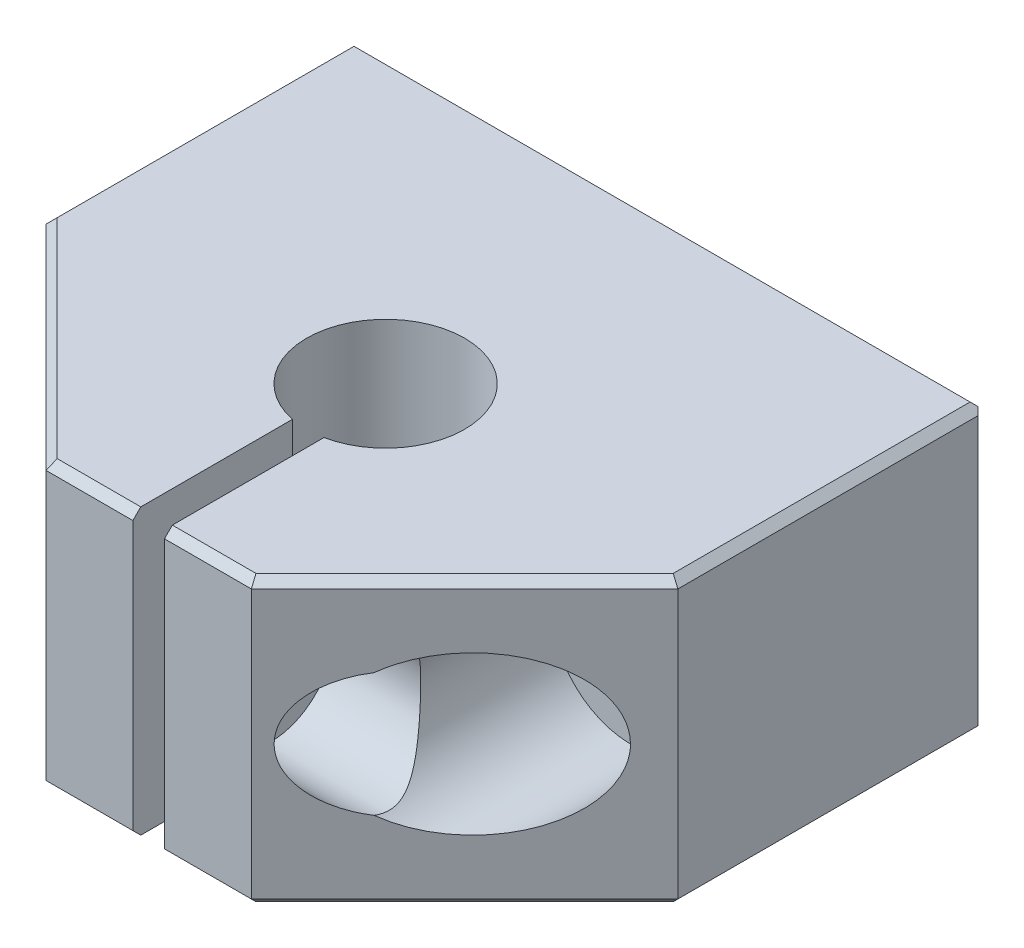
ISO-10303-21;
HEADER;
FILE_DESCRIPTION(('STEP AP214'),'2;1');
FILE_NAME('part.step','',(''),(''),'','','');
FILE_SCHEMA(('AUTOMOTIVE_DESIGN { 1 0 10303 214 1 1 1 1 }'));
ENDSEC;
DATA;
#1=APPLICATION_CONTEXT('core data for automotive mechanical design processes');
#2=APPLICATION_PROTOCOL_DEFINITION('international standard','automotive_design',2000,#1);
#3=PRODUCT_CONTEXT('',#1,'mechanical');
#4=PRODUCT('Part','Part','',(#3));
#5=PRODUCT_RELATED_PRODUCT_CATEGORY('part','',(#4));
#6=PRODUCT_DEFINITION_FORMATION('','',#4);
#7=PRODUCT_DEFINITION_CONTEXT('part definition',#1,'design');
#8=PRODUCT_DEFINITION('design','',#6,#7);
#9=PRODUCT_DEFINITION_SHAPE('','',#8);
#10=(LENGTH_UNIT() NAMED_UNIT(*) SI_UNIT(.MILLI.,.METRE.));
#11=(NAMED_UNIT(*) PLANE_ANGLE_UNIT() SI_UNIT($,.RADIAN.));
#12=(NAMED_UNIT(*) SI_UNIT($,.STERADIAN.) SOLID_ANGLE_UNIT());
#13=UNCERTAINTY_MEASURE_WITH_UNIT(LENGTH_MEASURE(1.E-05),#10,'distance_accuracy_value','');
#14=(GEOMETRIC_REPRESENTATION_CONTEXT(3) GLOBAL_UNCERTAINTY_ASSIGNED_CONTEXT((#13)) GLOBAL_UNIT_ASSIGNED_CONTEXT((#10,
#11,#12)) REPRESENTATION_CONTEXT('',''));
#15=CARTESIAN_POINT('',(0.,0.,0.));
#16=DIRECTION('',(0.,0.,1.));
#17=DIRECTION('',(1.,0.,0.));
#18=AXIS2_PLACEMENT_3D('',#15,#16,#17);
#19=CARTESIAN_POINT('',(-13.5,0.,-2.));
#20=DIRECTION('',(0.,0.,-1.));
#21=DIRECTION('',(-1.,0.,0.));
#22=AXIS2_PLACEMENT_3D('',#19,#20,#21);
#23=PLANE('',#22);
#24=CARTESIAN_POINT('',(-13.5,0.,-2.));
#25=DIRECTION('',(0.,0.,1.));
#26=DIRECTION('',(1.,0.,0.));
#27=AXIS2_PLACEMENT_3D('',#24,#25,#26);
#28=CIRCLE('',#27,2.6);
#29=CARTESIAN_POINT('',(-10.9,0.,-2.));
#30=VERTEX_POINT('',#29);
#31=EDGE_CURVE('E237',#30,#30,#28,.F.);
#32=ORIENTED_EDGE('',*,*,#31,.T.);
#33=EDGE_LOOP('',(#32));
#34=FACE_BOUND('',#33,.T.);
#35=CARTESIAN_POINT('',(-13.5,0.,-2.));
#36=DIRECTION('',(0.,0.,1.));
#37=DIRECTION('',(1.,0.,0.));
#38=AXIS2_PLACEMENT_3D('',#35,#36,#37);
#39=CIRCLE('',#38,5.);
#40=CARTESIAN_POINT('',(-8.5,0.,-2.));
#41=VERTEX_POINT('',#40);
#42=EDGE_CURVE('E20',#41,#41,#39,.T.);
#43=ORIENTED_EDGE('',*,*,#42,.T.);
#44=EDGE_LOOP('',(#43));
#45=FACE_BOUND('',#44,.T.);
#46=ADVANCED_FACE('F17',(#34,#45),#23,.F.);
#47=CARTESIAN_POINT('',(13.5,0.,-2.));
#48=DIRECTION('',(0.,0.,-1.));
#49=DIRECTION('',(-1.,0.,0.));
#50=AXIS2_PLACEMENT_3D('',#47,#48,#49);
#51=PLANE('',#50);
#52=CARTESIAN_POINT('',(13.5,0.,-2.));
#53=DIRECTION('',(0.,0.,1.));
#54=DIRECTION('',(1.,0.,0.));
#55=AXIS2_PLACEMENT_3D('',#52,#53,#54);
#56=CIRCLE('',#55,2.6);
#57=CARTESIAN_POINT('',(16.1,0.,-2.));
#58=VERTEX_POINT('',#57);
#59=EDGE_CURVE('E240',#58,#58,#56,.F.);
#60=ORIENTED_EDGE('',*,*,#59,.T.);
#61=EDGE_LOOP('',(#60));
#62=FACE_BOUND('',#61,.T.);
#63=CARTESIAN_POINT('',(13.5,0.,-2.));
#64=DIRECTION('',(0.,0.,1.));
#65=DIRECTION('',(1.,0.,0.));
#66=AXIS2_PLACEMENT_3D('',#63,#64,#65);
#67=CIRCLE('',#66,5.);
#68=CARTESIAN_POINT('',(18.5,0.,-2.));
#69=VERTEX_POINT('',#68);
#70=EDGE_CURVE('E160',#69,#69,#67,.T.);
#71=ORIENTED_EDGE('',*,*,#70,.T.);
#72=EDGE_LOOP('',(#71));
#73=FACE_BOUND('',#72,.T.);
#74=ADVANCED_FACE('F856',(#62,#73),#51,.F.);
#75=CARTESIAN_POINT('',(3.,0.,10.28));
#76=DIRECTION('',(-1.,0.,0.));
#77=DIRECTION('',(0.,0.,1.));
#78=AXIS2_PLACEMENT_3D('',#75,#76,#77);
#79=PLANE('',#78);
#80=CARTESIAN_POINT('',(3.,0.,10.28));
#81=DIRECTION('',(1.,0.,0.));
#82=DIRECTION('',(0.,0.,-1.));
#83=AXIS2_PLACEMENT_3D('',#80,#81,#82);
#84=CIRCLE('',#83,2.25);
#85=CARTESIAN_POINT('',(3.,0.,8.03));
#86=VERTEX_POINT('',#85);
#87=EDGE_CURVE('E198',#86,#86,#84,.F.);
#88=ORIENTED_EDGE('',*,*,#87,.T.);
#89=EDGE_LOOP('',(#88));
#90=FACE_BOUND('',#89,.T.);
#91=CARTESIAN_POINT('',(3.,0.,10.28));
#92=DIRECTION('',(1.,0.,0.));
#93=DIRECTION('',(0.,0.,-1.));
#94=AXIS2_PLACEMENT_3D('',#91,#92,#93);
#95=CIRCLE('',#94,4.);
#96=CARTESIAN_POINT('',(3.,0.,6.28));
#97=VERTEX_POINT('',#96);
#98=EDGE_CURVE('E161',#97,#97,#95,.T.);
#99=ORIENTED_EDGE('',*,*,#98,.T.);
#100=EDGE_LOOP('',(#99));
#101=FACE_BOUND('',#100,.T.);
#102=ADVANCED_FACE('F849',(#90,#101),#79,.F.);
#103=CARTESIAN_POINT('',(20.,-9.,14.5));
#104=DIRECTION('',(0.,0.707106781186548,-0.707106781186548));
#105=DIRECTION('',(0.,0.707106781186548,0.707106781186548));
#106=AXIS2_PLACEMENT_3D('',#103,#104,#105);
#107=PLANE('',#106);
#108=DIRECTION('',(1.,0.,0.));
#109=VECTOR('',#108,1.);
#110=CARTESIAN_POINT('',(0.,-8.5,15.));
#111=LINE('',#110,#109);
#112=CARTESIAN_POINT('',(0.999999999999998,-8.5,15.));
#113=VERTEX_POINT('',#112);
#114=CARTESIAN_POINT('',(6.49999999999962,-8.49999999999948,14.9999999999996));
#115=VERTEX_POINT('',#114);
#116=EDGE_CURVE('E371',#113,#115,#111,.T.);
#117=ORIENTED_EDGE('',*,*,#116,.F.);
#118=DIRECTION('',(0.,0.707106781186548,0.707106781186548));
#119=VECTOR('',#118,1.);
#120=CARTESIAN_POINT('',(0.999999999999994,-9.,14.5));
#121=LINE('',#120,#119);
#122=CARTESIAN_POINT('',(0.999999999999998,-9.,14.5));
#123=VERTEX_POINT('',#122);
#124=EDGE_CURVE('E409',#123,#113,#121,.T.);
#125=ORIENTED_EDGE('',*,*,#124,.F.);
#126=DIRECTION('',(1.,0.,0.));
#127=VECTOR('',#126,1.);
#128=CARTESIAN_POINT('',(0.,-9.,14.5));
#129=LINE('',#128,#127);
#130=CARTESIAN_POINT('',(6.29289321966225,-8.99999999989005,14.4999999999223));
#131=VERTEX_POINT('',#130);
#132=EDGE_CURVE('E362',#131,#123,#129,.F.);
#133=ORIENTED_EDGE('',*,*,#132,.F.);
#134=DIRECTION('',(0.281084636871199,0.678598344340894,0.678598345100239));
#135=VECTOR('',#134,1.);
#136=CARTESIAN_POINT('',(6.29289321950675,-8.99999999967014,14.4999999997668));
#137=LINE('',#136,#135);
#138=EDGE_CURVE('E236',#131,#115,#137,.T.);
#139=ORIENTED_EDGE('',*,*,#138,.T.);
#140=EDGE_LOOP('',(#117,#125,#133,#139));
#141=FACE_BOUND('',#140,.T.);
#142=ADVANCED_FACE('F458',(#141),#107,.F.);
#143=CARTESIAN_POINT('',(20.,-9.,14.5));
#144=DIRECTION('',(0.,0.707106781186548,-0.707106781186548));
#145=DIRECTION('',(0.,0.707106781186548,0.707106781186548));
#146=AXIS2_PLACEMENT_3D('',#143,#144,#145);
#147=PLANE('',#146);
#148=DIRECTION('',(1.,0.,0.));
#149=VECTOR('',#148,1.);
#150=CARTESIAN_POINT('',(0.,-9.,14.5));
#151=LINE('',#150,#149);
#152=CARTESIAN_POINT('',(-1.,-9.,14.5));
#153=VERTEX_POINT('',#152);
#154=CARTESIAN_POINT('',(-6.29289321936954,-8.99999999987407,14.4999999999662));
#155=VERTEX_POINT('',#154);
#156=EDGE_CURVE('E197',#153,#155,#151,.F.);
#157=ORIENTED_EDGE('',*,*,#156,.F.);
#158=DIRECTION('',(0.,0.707106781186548,0.707106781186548));
#159=VECTOR('',#158,1.);
#160=CARTESIAN_POINT('',(-1.00000000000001,-9.,14.5));
#161=LINE('',#160,#159);
#162=CARTESIAN_POINT('',(-1.,-8.5000000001,14.9999999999));
#163=VERTEX_POINT('',#162);
#164=EDGE_CURVE('E406',#163,#153,#161,.F.);
#165=ORIENTED_EDGE('',*,*,#164,.F.);
#166=DIRECTION('',(1.,0.,0.));
#167=VECTOR('',#166,1.);
#168=CARTESIAN_POINT('',(0.,-8.5,15.));
#169=LINE('',#168,#167);
#170=CARTESIAN_POINT('',(-6.50000000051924,-8.49999999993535,14.9999999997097));
#171=VERTEX_POINT('',#170);
#172=EDGE_CURVE('E196',#171,#163,#169,.T.);
#173=ORIENTED_EDGE('',*,*,#172,.F.);
#174=DIRECTION('',(0.281084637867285,-0.678598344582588,-0.678598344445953));
#175=VECTOR('',#174,1.);
#176=CARTESIAN_POINT('',(-6.5000000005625,-8.50000000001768,14.9999999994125));
#177=LINE('',#176,#175);
#178=EDGE_CURVE('E408',#171,#155,#177,.T.);
#179=ORIENTED_EDGE('',*,*,#178,.T.);
#180=EDGE_LOOP('',(#157,#165,#173,#179));
#181=FACE_BOUND('',#180,.T.);
#182=ADVANCED_FACE('F837',(#181),#147,.F.);
#183=CARTESIAN_POINT('',(-21.5,-8.5,0.));
#184=DIRECTION('',(0.49999999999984,0.707106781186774,-0.49999999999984));
#185=DIRECTION('',(-0.8164965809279,0.57735026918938,0.));
#186=AXIS2_PLACEMENT_3D('',#183,#184,#185);
#187=PLANE('',#186);
#188=DIRECTION('',(-0.707106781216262,0.,-0.707106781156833));
#189=VECTOR('',#188,1.);
#190=CARTESIAN_POINT('',(-6.29289321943,-9.,14.4999999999));
#191=LINE('',#190,#189);
#192=CARTESIAN_POINT('',(-19.5000000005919,-8.99999999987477,1.29289321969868));
#193=VERTEX_POINT('',#192);
#194=EDGE_CURVE('E264',#155,#193,#191,.T.);
#195=ORIENTED_EDGE('',*,*,#194,.F.);
#196=ORIENTED_EDGE('',*,*,#178,.F.);
#197=DIRECTION('',(0.707106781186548,0.,0.707106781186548));
#198=VECTOR('',#197,1.);
#199=CARTESIAN_POINT('',(-20.,-8.50000000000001,1.5));
#200=LINE('',#199,#198);
#201=CARTESIAN_POINT('',(-20.,-8.5,1.5));
#202=VERTEX_POINT('',#201);
#203=EDGE_CURVE('E412',#202,#171,#200,.T.);
#204=ORIENTED_EDGE('',*,*,#203,.F.);
#205=DIRECTION('',(0.678598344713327,-0.678598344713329,-0.281084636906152));
#206=VECTOR('',#205,1.);
#207=CARTESIAN_POINT('',(-20.,-8.5,1.50000000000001));
#208=LINE('',#207,#206);
#209=EDGE_CURVE('E267',#202,#193,#208,.T.);
#210=ORIENTED_EDGE('',*,*,#209,.T.);
#211=EDGE_LOOP('',(#195,#196,#204,#210));
#212=FACE_BOUND('',#211,.T.);
#213=ADVANCED_FACE('F539',(#212),#187,.F.);
#214=CARTESIAN_POINT('',(-13.5,0.,14.5));
#215=DIRECTION('',(0.,0.,1.));
#216=DIRECTION('',(1.,0.,0.));
#217=AXIS2_PLACEMENT_3D('',#214,#215,#216);
#218=CYLINDRICAL_SURFACE('',#217,5.);
#219=ORIENTED_EDGE('',*,*,#42,.F.);
#220=EDGE_LOOP('',(#219));
#221=FACE_BOUND('',#220,.T.);
#222=CARTESIAN_POINT('',(-8.91742430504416,-2.,10.2799999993));
#223=CARTESIAN_POINT('',(-8.91741825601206,-1.99999399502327,10.172853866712));
#224=CARTESIAN_POINT('',(-8.91361517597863,-1.99134136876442,10.0655617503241));
#225=CARTESIAN_POINT('',(-8.8988885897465,-1.95706499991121,9.85405762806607));
#226=CARTESIAN_POINT('',(-8.8879474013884,-1.93139911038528,9.74985394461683));
#227=CARTESIAN_POINT('',(-8.86038649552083,-1.86421340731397,9.54787599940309));
#228=CARTESIAN_POINT('',(-8.8437837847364,-1.82274103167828,9.450083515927));
#229=CARTESIAN_POINT('',(-8.80682017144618,-1.72532797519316,9.26297134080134));
#230=CARTESIAN_POINT('',(-8.7864656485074,-1.66941179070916,9.17363765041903));
#231=CARTESIAN_POINT('',(-8.75532734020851,-1.57766971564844,9.04979872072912));
#232=CARTESIAN_POINT('',(-8.74518136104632,-1.54687903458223,9.01130404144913));
#233=CARTESIAN_POINT('',(-8.72473688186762,-1.48256674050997,8.93671236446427));
#234=CARTESIAN_POINT('',(-8.71443838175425,-1.44904512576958,8.90061536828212));
#235=CARTESIAN_POINT('',(-8.68108850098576,-1.33594345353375,8.78751893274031));
#236=CARTESIAN_POINT('',(-8.65815063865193,-1.25106102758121,8.71565327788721));
#237=CARTESIAN_POINT('',(-8.61493199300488,-1.06994705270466,8.58659879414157));
#238=CARTESIAN_POINT('',(-8.59465674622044,-0.973692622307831,8.52944031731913));
#239=CARTESIAN_POINT('',(-8.55888524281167,-0.771949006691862,8.43156879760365));
#240=CARTESIAN_POINT('',(-8.54340288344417,-0.666434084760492,8.39090347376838));
#241=CARTESIAN_POINT('',(-8.51906176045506,-0.44953698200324,8.3279236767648));
#242=CARTESIAN_POINT('',(-8.5101843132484,-0.338172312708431,8.30555742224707));
#243=CARTESIAN_POINT('',(-8.50340340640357,-0.188267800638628,8.28852208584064));
#244=CARTESIAN_POINT('',(-8.50212981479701,-0.150702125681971,8.2853295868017));
#245=CARTESIAN_POINT('',(-8.50042730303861,-0.0754301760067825,8.28106750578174));
#246=CARTESIAN_POINT('',(-8.49999840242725,-0.0377238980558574,8.27999797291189));
#247=CARTESIAN_POINT('',(-8.50000455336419,0.107534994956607,8.28000577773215));
#248=CARTESIAN_POINT('',(-8.50350725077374,0.215213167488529,8.28871884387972));
#249=CARTESIAN_POINT('',(-8.51716969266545,0.427524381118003,8.32325777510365));
#250=CARTESIAN_POINT('',(-8.52734539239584,0.532149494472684,8.34912465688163));
#251=CARTESIAN_POINT('',(-8.55326574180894,0.735022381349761,8.41689649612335));
#252=CARTESIAN_POINT('',(-8.56899691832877,0.833284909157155,8.45876267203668));
#253=CARTESIAN_POINT('',(-8.60446470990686,1.02120791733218,8.5571074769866));
#254=CARTESIAN_POINT('',(-8.62419436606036,1.1108829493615,8.6135607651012));
#255=CARTESIAN_POINT('',(-8.65452500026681,1.23408889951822,8.70539925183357));
#256=CARTESIAN_POINT('',(-8.66429077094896,1.27174985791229,8.73566168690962));
#257=CARTESIAN_POINT('',(-8.6840807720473,1.34474935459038,8.79879177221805));
#258=CARTESIAN_POINT('',(-8.69410500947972,1.3800878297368,8.83165949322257));
#259=CARTESIAN_POINT('',(-8.72734563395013,1.49280848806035,8.94438415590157));
#260=CARTESIAN_POINT('',(-8.75071537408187,1.56491071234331,9.02961477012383));
#261=CARTESIAN_POINT('',(-8.79530295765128,1.69426567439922,9.21138342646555));
#262=CARTESIAN_POINT('',(-8.81651680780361,1.75149115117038,9.30794176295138));
#263=CARTESIAN_POINT('',(-8.85429756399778,1.84938312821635,9.51030497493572));
#264=CARTESIAN_POINT('',(-8.87085366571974,1.89001122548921,9.61613061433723));
#265=CARTESIAN_POINT('',(-8.89702183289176,1.95288834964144,9.83385907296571));
#266=CARTESIAN_POINT('',(-8.90664120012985,1.97515670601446,9.9457553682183));
#267=CARTESIAN_POINT('',(-8.91724806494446,1.99963793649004,10.165862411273));
#268=CARTESIAN_POINT('',(-8.91868207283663,2.00288849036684,10.2739364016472));
#269=CARTESIAN_POINT('',(-8.91391922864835,1.99195832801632,10.4890387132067));
#270=CARTESIAN_POINT('',(-8.90772174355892,1.97777616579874,10.5960669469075));
#271=CARTESIAN_POINT('',(-8.88891207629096,1.93349640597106,10.801765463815));
#272=CARTESIAN_POINT('',(-8.87655770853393,1.90403667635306,10.9005989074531));
#273=CARTESIAN_POINT('',(-8.84701435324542,1.83065002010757,11.0919216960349));
#274=CARTESIAN_POINT('',(-8.82982637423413,1.78672611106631,11.184412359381));
#275=CARTESIAN_POINT('',(-8.79477138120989,1.69204971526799,11.3499942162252));
#276=CARTESIAN_POINT('',(-8.77726287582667,1.64285522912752,11.4240613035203));
#277=CARTESIAN_POINT('',(-8.74119141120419,1.53524025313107,11.5648703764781));
#278=CARTESIAN_POINT('',(-8.72262834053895,1.47681878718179,11.6316115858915));
#279=CARTESIAN_POINT('',(-8.68106440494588,1.33585786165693,11.772565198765));
#280=CARTESIAN_POINT('',(-8.65811982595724,1.25094612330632,11.8444444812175));
#281=CARTESIAN_POINT('',(-8.61490862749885,1.06983489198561,11.9734651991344));
#282=CARTESIAN_POINT('',(-8.59464457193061,0.973624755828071,12.0305925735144));
#283=CARTESIAN_POINT('',(-8.5588842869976,0.771942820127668,12.1284342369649));
#284=CARTESIAN_POINT('',(-8.54340407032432,0.66644140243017,12.1690935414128));
#285=CARTESIAN_POINT('',(-8.51906245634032,0.44954641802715,12.2320744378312));
#286=CARTESIAN_POINT('',(-8.51018382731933,0.33816900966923,12.2544437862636));
#287=CARTESIAN_POINT('',(-8.50340289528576,0.188254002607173,12.2714792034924));
#288=CARTESIAN_POINT('',(-8.50212947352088,0.150690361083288,12.2746712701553));
#289=CARTESIAN_POINT('',(-8.50042723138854,0.0754236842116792,12.2789326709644));
#290=CARTESIAN_POINT('',(-8.49999840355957,0.0377206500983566,12.2800020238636));
#291=CARTESIAN_POINT('',(-8.50000455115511,-0.10753456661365,12.2799942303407));
#292=CARTESIAN_POINT('',(-8.50350722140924,-0.215212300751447,12.2712812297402));
#293=CARTESIAN_POINT('',(-8.51716961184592,-0.427523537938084,12.2367424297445));
#294=CARTESIAN_POINT('',(-8.5273453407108,-0.532149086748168,12.2108754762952));
#295=CARTESIAN_POINT('',(-8.55326567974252,-0.735021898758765,12.1431036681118));
#296=CARTESIAN_POINT('',(-8.56899676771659,-0.833283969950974,12.1012377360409));
#297=CARTESIAN_POINT('',(-8.60446452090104,-1.02120705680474,12.0028930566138));
#298=CARTESIAN_POINT('',(-8.62419426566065,-1.11088254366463,11.9464395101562));
#299=CARTESIAN_POINT('',(-8.65452583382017,-1.23409228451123,11.8545982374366));
#300=CARTESIAN_POINT('',(-8.66429247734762,-1.27175643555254,11.8243330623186));
#301=CARTESIAN_POINT('',(-8.68408373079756,-1.34475998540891,11.7611985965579));
#302=CARTESIAN_POINT('',(-8.69410833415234,-1.38009944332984,11.7283293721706));
#303=CARTESIAN_POINT('',(-8.72734507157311,-1.49280580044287,11.6156174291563));
#304=CARTESIAN_POINT('',(-8.75071043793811,-1.56489510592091,11.5304045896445));
#305=CARTESIAN_POINT('',(-8.79529844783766,-1.69425388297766,11.3486357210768));
#306=CARTESIAN_POINT('',(-8.81651629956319,-1.7514906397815,11.2520553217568));
#307=CARTESIAN_POINT('',(-8.85431906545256,-1.84943803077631,11.0495855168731));
#308=CARTESIAN_POINT('',(-8.8708893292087,-1.8900965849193,10.9436680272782));
#309=CARTESIAN_POINT('',(-8.89704231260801,-1.95293784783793,10.72587543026));
#310=CARTESIAN_POINT('',(-8.90664615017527,-1.97517642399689,10.6140194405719));
#311=CARTESIAN_POINT('',(-8.9138649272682,-1.99182677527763,10.4643821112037));
#312=CARTESIAN_POINT('',(-8.91519629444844,-1.99488844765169,10.4275907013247));
#313=CARTESIAN_POINT('',(-8.91697704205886,-1.99897613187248,10.3538719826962));
#314=CARTESIAN_POINT('',(-8.917426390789,-2.00000207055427,10.31694466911));
#315=CARTESIAN_POINT('',(-8.91742430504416,-2.,10.2799999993));
#316=B_SPLINE_CURVE_WITH_KNOTS('',3,(#222,#223,#224,#225,#226,#227,#228,#229,#230,#231,#232,
#233,#234,#235,#236,#237,#238,#239,#240,#241,#242,#243,#244,#245,#246,#247,#248,#249,#250,#251,
#252,#253,#254,#255,#256,#257,#258,#259,#260,#261,#262,#263,#264,#265,#266,#267,#268,#269,#270,
#271,#272,#273,#274,#275,#276,#277,#278,#279,#280,#281,#282,#283,#284,#285,#286,#287,#288,#289,
#290,#291,#292,#293,#294,#295,#296,#297,#298,#299,#300,#301,#302,#303,#304,#305,#306,#307,#308,
#309,#310,#311,#312,#313,#314,#315),.UNSPECIFIED.,.T.,.F.,(4,2,2,2,2,2,2,2,2,2,2,2,2,2,2,2,2,2,
2,2,2,2,2,2,2,2,2,2,2,2,2,2,2,2,2,2,2,2,2,2,2,2,2,2,2,2,4),(0.,0.321289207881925,
0.643377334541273,0.964506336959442,1.28509424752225,1.43596539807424,1.58683664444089,
1.92586883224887,2.26559518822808,2.6062975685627,2.94603248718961,3.05914891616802,
3.17226796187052,3.49472286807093,3.81795159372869,4.14040174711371,4.46229545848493,
4.61006241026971,4.75783337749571,5.09834144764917,5.43946915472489,5.78138175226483,
6.12293391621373,6.44566209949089,6.76841705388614,7.07866810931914,7.38885447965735,
7.65995279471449,7.93107980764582,8.27029746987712,8.60983728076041,8.95050160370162,
9.29027355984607,9.40338386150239,9.51649316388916,9.83894677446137,10.1621767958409,
10.4846254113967,10.8065206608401,10.9543005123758,11.1020766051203,11.4425220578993,
11.783711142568,12.125963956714,12.4671748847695,12.5779534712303,12.6887360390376),.UNSPECIFIED.);
#317=CARTESIAN_POINT('',(-8.91742430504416,-2.,10.2799999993));
#318=VERTEX_POINT('',#317);
#319=EDGE_CURVE('E189',#318,#318,#316,.T.);
#320=ORIENTED_EDGE('',*,*,#319,.T.);
#321=EDGE_LOOP('',(#320));
#322=FACE_BOUND('',#321,.T.);
#323=CARTESIAN_POINT('',(-13.5,0.,8.));
#324=DIRECTION('',(-0.707106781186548,0.,0.707106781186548));
#325=DIRECTION('',(0.707106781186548,0.,0.707106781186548));
#326=AXIS2_PLACEMENT_3D('',#323,#324,#325);
#327=ELLIPSE('',#326,7.07106781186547,5.);
#328=CARTESIAN_POINT('',(-8.5,0.,13.));
#329=VERTEX_POINT('',#328);
#330=EDGE_CURVE('E184',#329,#329,#327,.F.);
#331=ORIENTED_EDGE('',*,*,#330,.F.);
#332=EDGE_LOOP('',(#331));
#333=FACE_BOUND('',#332,.T.);
#334=ADVANCED_FACE('F200',(#221,#322,#333),#218,.F.);
#335=CARTESIAN_POINT('',(-20.,-8.5,-18.));
#336=DIRECTION('',(0.707106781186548,0.707106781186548,0.));
#337=DIRECTION('',(-0.707106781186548,0.707106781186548,0.));
#338=AXIS2_PLACEMENT_3D('',#335,#336,#337);
#339=PLANE('',#338);
#340=DIRECTION('',(0.,0.,1.));
#341=VECTOR('',#340,1.);
#342=CARTESIAN_POINT('',(-20.,-8.5,-18.));
#343=LINE('',#342,#341);
#344=CARTESIAN_POINT('',(-20.,-8.50000000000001,-17.5));
#345=VERTEX_POINT('',#344);
#346=EDGE_CURVE('E187',#345,#202,#343,.T.);
#347=ORIENTED_EDGE('',*,*,#346,.F.);
#348=DIRECTION('',(0.577350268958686,-0.577350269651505,-0.577350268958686));
#349=VECTOR('',#348,1.);
#350=CARTESIAN_POINT('',(-20.,-8.50000000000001,-17.5));
#351=LINE('',#350,#349);
#352=CARTESIAN_POINT('',(-19.7500000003,-8.75000000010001,-17.7499999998));
#353=VERTEX_POINT('',#352);
#354=EDGE_CURVE('E253',#345,#353,#351,.T.);
#355=ORIENTED_EDGE('',*,*,#354,.T.);
#356=DIRECTION('',(0.577350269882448,-0.577350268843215,0.577350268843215));
#357=VECTOR('',#356,1.);
#358=CARTESIAN_POINT('',(-19.7500000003,-8.75000000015,-17.74999999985));
#359=LINE('',#358,#357);
#360=CARTESIAN_POINT('',(-19.5000000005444,-8.99999999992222,-17.5000000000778));
#361=VERTEX_POINT('',#360);
#362=EDGE_CURVE('E242',#353,#361,#359,.T.);
#363=ORIENTED_EDGE('',*,*,#362,.T.);
#364=DIRECTION('',(0.,0.,-1.));
#365=VECTOR('',#364,1.);
#366=CARTESIAN_POINT('',(-19.5000000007,-9.,-4.08448721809));
#367=LINE('',#366,#365);
#368=EDGE_CURVE('E261',#193,#361,#367,.T.);
#369=ORIENTED_EDGE('',*,*,#368,.F.);
#370=ORIENTED_EDGE('',*,*,#209,.F.);
#371=EDGE_LOOP('',(#347,#355,#363,#369,#370));
#372=FACE_BOUND('',#371,.T.);
#373=ADVANCED_FACE('F543',(#372),#339,.F.);
#374=CARTESIAN_POINT('',(-20.,17.5,-17.5));
#375=DIRECTION('',(0.707106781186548,0.,0.707106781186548));
#376=DIRECTION('',(0.707106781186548,0.,-0.707106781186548));
#377=AXIS2_PLACEMENT_3D('',#374,#375,#376);
#378=PLANE('',#377);
#379=DIRECTION('',(0.,1.,0.));
#380=VECTOR('',#379,1.);
#381=CARTESIAN_POINT('',(-20.,9.,-17.5));
#382=LINE('',#381,#380);
#383=CARTESIAN_POINT('',(-20.,8.5,-17.5));
#384=VERTEX_POINT('',#383);
#385=EDGE_CURVE('E313',#384,#345,#382,.F.);
#386=ORIENTED_EDGE('',*,*,#385,.F.);
#387=DIRECTION('',(-0.577350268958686,-0.577350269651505,0.577350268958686));
#388=VECTOR('',#387,1.);
#389=CARTESIAN_POINT('',(-19.7500000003,8.75,-17.7499999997));
#390=LINE('',#389,#388);
#391=CARTESIAN_POINT('',(-19.7500000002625,8.75,-17.7499999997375));
#392=VERTEX_POINT('',#391);
#393=EDGE_CURVE('E308',#392,#384,#390,.T.);
#394=ORIENTED_EDGE('',*,*,#393,.F.);
#395=DIRECTION('',(-0.577350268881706,0.577350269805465,0.577350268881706));
#396=VECTOR('',#395,1.);
#397=CARTESIAN_POINT('',(-19.5000000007,8.5,-17.9999999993));
#398=LINE('',#397,#396);
#399=CARTESIAN_POINT('',(-19.5000000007,8.5000000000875,-17.9999999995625));
#400=VERTEX_POINT('',#399);
#401=EDGE_CURVE('E270',#400,#392,#398,.T.);
#402=ORIENTED_EDGE('',*,*,#401,.F.);
#403=DIRECTION('',(0.,1.,0.));
#404=VECTOR('',#403,1.);
#405=CARTESIAN_POINT('',(-19.5000000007,9.,-18.));
#406=LINE('',#405,#404);
#407=CARTESIAN_POINT('',(-19.5000000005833,-8.50000000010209,-17.9999999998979));
#408=VERTEX_POINT('',#407);
#409=EDGE_CURVE('E293',#408,#400,#406,.T.);
#410=ORIENTED_EDGE('',*,*,#409,.F.);
#411=DIRECTION('',(-0.577350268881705,-0.577350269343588,0.577350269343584));
#412=VECTOR('',#411,1.);
#413=CARTESIAN_POINT('',(-19.5000000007,-8.50000000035,-17.99999999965));
#414=LINE('',#413,#412);
#415=EDGE_CURVE('E246',#408,#353,#414,.T.);
#416=ORIENTED_EDGE('',*,*,#415,.T.);
#417=ORIENTED_EDGE('',*,*,#354,.F.);
#418=EDGE_LOOP('',(#386,#394,#402,#410,#416,#417));
#419=FACE_BOUND('',#418,.T.);
#420=ADVANCED_FACE('F545',(#419),#378,.F.);
#421=CARTESIAN_POINT('',(-20.,-9.,-17.5));
#422=DIRECTION('',(0.,0.707106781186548,0.707106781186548));
#423=DIRECTION('',(0.,-0.707106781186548,0.707106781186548));
#424=AXIS2_PLACEMENT_3D('',#421,#422,#423);
#425=PLANE('',#424);
#426=ORIENTED_EDGE('',*,*,#415,.F.);
#427=DIRECTION('',(-1.,0.,0.));
#428=VECTOR('',#427,1.);
#429=CARTESIAN_POINT('',(20.,-8.5,-18.));
#430=LINE('',#429,#428);
#431=CARTESIAN_POINT('',(19.5,-8.5,-18.));
#432=VERTEX_POINT('',#431);
#433=EDGE_CURVE('E183',#432,#408,#430,.T.);
#434=ORIENTED_EDGE('',*,*,#433,.F.);
#435=DIRECTION('',(0.577350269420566,-0.577350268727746,0.577350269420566));
#436=VECTOR('',#435,1.);
#437=CARTESIAN_POINT('',(19.5,-8.5,-18.));
#438=LINE('',#437,#436);
#439=CARTESIAN_POINT('',(19.7500000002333,-8.74999999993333,-17.7499999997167));
#440=VERTEX_POINT('',#439);
#441=EDGE_CURVE('E282',#432,#440,#438,.T.);
#442=ORIENTED_EDGE('',*,*,#441,.T.);
#443=DIRECTION('',(-0.577350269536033,-0.577350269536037,0.577350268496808));
#444=VECTOR('',#443,1.);
#445=CARTESIAN_POINT('',(19.75000000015,-8.74999999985,-17.7499999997));
#446=LINE('',#445,#444);
#447=CARTESIAN_POINT('',(19.5,-9.,-17.5));
#448=VERTEX_POINT('',#447);
#449=EDGE_CURVE('E239',#440,#448,#446,.T.);
#450=ORIENTED_EDGE('',*,*,#449,.T.);
#451=DIRECTION('',(1.,0.,0.));
#452=VECTOR('',#451,1.);
#453=CARTESIAN_POINT('',(0.,-9.,-17.5));
#454=LINE('',#453,#452);
#455=EDGE_CURVE('E263',#361,#448,#454,.T.);
#456=ORIENTED_EDGE('',*,*,#455,.F.);
#457=ORIENTED_EDGE('',*,*,#362,.F.);
#458=EDGE_LOOP('',(#426,#434,#442,#450,#456,#457));
#459=FACE_BOUND('',#458,.T.);
#460=ADVANCED_FACE('F444',(#459),#425,.F.);
#461=CARTESIAN_POINT('',(13.5,0.,-10.));
#462=DIRECTION('',(0.,0.,1.));
#463=DIRECTION('',(1.,0.,0.));
#464=AXIS2_PLACEMENT_3D('',#461,#462,#463);
#465=CYLINDRICAL_SURFACE('',#464,2.6);
#466=CARTESIAN_POINT('',(13.5,0.,-18.));
#467=DIRECTION('',(0.,0.,1.));
#468=DIRECTION('',(1.,0.,0.));
#469=AXIS2_PLACEMENT_3D('',#466,#467,#468);
#470=CIRCLE('',#469,2.6);
#471=CARTESIAN_POINT('',(16.1,0.,-18.));
#472=VERTEX_POINT('',#471);
#473=EDGE_CURVE('E180',#472,#472,#470,.T.);
#474=ORIENTED_EDGE('',*,*,#473,.F.);
#475=EDGE_LOOP('',(#474));
#476=FACE_BOUND('',#475,.T.);
#477=ORIENTED_EDGE('',*,*,#59,.F.);
#478=EDGE_LOOP('',(#477));
#479=FACE_BOUND('',#478,.T.);
#480=ADVANCED_FACE('F700',(#476,#479),#465,.F.);
#481=CARTESIAN_POINT('',(-13.5,0.,-10.));
#482=DIRECTION('',(0.,0.,1.));
#483=DIRECTION('',(1.,0.,0.));
#484=AXIS2_PLACEMENT_3D('',#481,#482,#483);
#485=CYLINDRICAL_SURFACE('',#484,2.6);
#486=CARTESIAN_POINT('',(-13.5,0.,-18.));
#487=DIRECTION('',(0.,0.,1.));
#488=DIRECTION('',(1.,0.,0.));
#489=AXIS2_PLACEMENT_3D('',#486,#487,#488);
#490=CIRCLE('',#489,2.6);
#491=CARTESIAN_POINT('',(-10.9,0.,-18.));
#492=VERTEX_POINT('',#491);
#493=EDGE_CURVE('E176',#492,#492,#490,.T.);
#494=ORIENTED_EDGE('',*,*,#493,.F.);
#495=EDGE_LOOP('',(#494));
#496=FACE_BOUND('',#495,.T.);
#497=ORIENTED_EDGE('',*,*,#31,.F.);
#498=EDGE_LOOP('',(#497));
#499=FACE_BOUND('',#498,.T.);
#500=ADVANCED_FACE('F695',(#496,#499),#485,.F.);
#501=CARTESIAN_POINT('',(19.5,-9.,-18.));
#502=DIRECTION('',(-0.707106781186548,0.707106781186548,0.));
#503=DIRECTION('',(-0.707106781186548,-0.707106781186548,0.));
#504=AXIS2_PLACEMENT_3D('',#501,#502,#503);
#505=PLANE('',#504);
#506=DIRECTION('',(0.,0.,-1.));
#507=VECTOR('',#506,1.);
#508=CARTESIAN_POINT('',(19.5,-9.,-4.08448721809));
#509=LINE('',#508,#507);
#510=CARTESIAN_POINT('',(19.5000000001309,-9.00000000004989,1.29289321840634));
#511=VERTEX_POINT('',#510);
#512=EDGE_CURVE('E432',#448,#511,#509,.F.);
#513=ORIENTED_EDGE('',*,*,#512,.F.);
#514=ORIENTED_EDGE('',*,*,#449,.F.);
#515=DIRECTION('',(0.577350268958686,0.577350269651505,0.577350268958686));
#516=VECTOR('',#515,1.);
#517=CARTESIAN_POINT('',(19.7500000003,-8.75,-17.7499999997));
#518=LINE('',#517,#516);
#519=CARTESIAN_POINT('',(20.,-8.5,-17.5));
#520=VERTEX_POINT('',#519);
#521=EDGE_CURVE('E287',#440,#520,#518,.T.);
#522=ORIENTED_EDGE('',*,*,#521,.T.);
#523=DIRECTION('',(0.,0.,-1.));
#524=VECTOR('',#523,1.);
#525=CARTESIAN_POINT('',(20.,-8.5,1.5));
#526=LINE('',#525,#524);
#527=CARTESIAN_POINT('',(19.9999999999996,-8.49999999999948,1.49999999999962));
#528=VERTEX_POINT('',#527);
#529=EDGE_CURVE('E179',#528,#520,#526,.T.);
#530=ORIENTED_EDGE('',*,*,#529,.F.);
#531=DIRECTION('',(-0.678598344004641,-0.678598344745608,-0.281084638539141));
#532=VECTOR('',#531,1.);
#533=CARTESIAN_POINT('',(19.9999999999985,-8.49999999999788,1.4999999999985));
#534=LINE('',#533,#532);
#535=EDGE_CURVE('E384',#528,#511,#534,.T.);
#536=ORIENTED_EDGE('',*,*,#535,.T.);
#537=EDGE_LOOP('',(#513,#514,#522,#530,#536));
#538=FACE_BOUND('',#537,.T.);
#539=ADVANCED_FACE('F448',(#538),#505,.F.);
#540=CARTESIAN_POINT('',(20.,-17.5,-17.5));
#541=DIRECTION('',(-0.707106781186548,0.,0.707106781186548));
#542=DIRECTION('',(0.707106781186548,0.,0.707106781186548));
#543=AXIS2_PLACEMENT_3D('',#540,#541,#542);
#544=PLANE('',#543);
#545=DIRECTION('',(0.,1.,0.));
#546=VECTOR('',#545,1.);
#547=CARTESIAN_POINT('',(20.,9.,-17.5));
#548=LINE('',#547,#546);
#549=CARTESIAN_POINT('',(20.,8.50000000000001,-17.5));
#550=VERTEX_POINT('',#549);
#551=EDGE_CURVE('E376',#520,#550,#548,.T.);
#552=ORIENTED_EDGE('',*,*,#551,.F.);
#553=ORIENTED_EDGE('',*,*,#521,.F.);
#554=ORIENTED_EDGE('',*,*,#441,.F.);
#555=DIRECTION('',(0.,1.,0.));
#556=VECTOR('',#555,1.);
#557=CARTESIAN_POINT('',(19.5,9.,-18.));
#558=LINE('',#557,#556);
#559=CARTESIAN_POINT('',(19.5000000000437,8.50000000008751,-17.9999999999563));
#560=VERTEX_POINT('',#559);
#561=EDGE_CURVE('E290',#560,#432,#558,.F.);
#562=ORIENTED_EDGE('',*,*,#561,.F.);
#563=DIRECTION('',(-0.577350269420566,-0.577350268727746,-0.577350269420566));
#564=VECTOR('',#563,1.);
#565=CARTESIAN_POINT('',(19.7500000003,8.75000000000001,-17.7499999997));
#566=LINE('',#565,#564);
#567=CARTESIAN_POINT('',(19.75000000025,8.74999999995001,-17.7499999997));
#568=VERTEX_POINT('',#567);
#569=EDGE_CURVE('E280',#568,#560,#566,.T.);
#570=ORIENTED_EDGE('',*,*,#569,.F.);
#571=DIRECTION('',(-0.577350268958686,0.577350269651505,-0.577350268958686));
#572=VECTOR('',#571,1.);
#573=CARTESIAN_POINT('',(20.,8.50000000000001,-17.5));
#574=LINE('',#573,#572);
#575=EDGE_CURVE('E387',#550,#568,#574,.T.);
#576=ORIENTED_EDGE('',*,*,#575,.F.);
#577=EDGE_LOOP('',(#552,#553,#554,#562,#570,#576));
#578=FACE_BOUND('',#577,.T.);
#579=ADVANCED_FACE('F687',(#578),#544,.F.);
#580=CARTESIAN_POINT('',(21.1464466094,-9.,-0.353553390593));
#581=DIRECTION('',(-0.49999999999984,0.707106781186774,-0.49999999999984));
#582=DIRECTION('',(-0.8164965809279,-0.57735026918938,0.));
#583=AXIS2_PLACEMENT_3D('',#580,#581,#582);
#584=PLANE('',#583);
#585=DIRECTION('',(-0.707106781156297,0.,0.707106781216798));
#586=VECTOR('',#585,1.);
#587=CARTESIAN_POINT('',(19.5000000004,-9.,1.29289321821));
#588=LINE('',#587,#586);
#589=EDGE_CURVE('E365',#511,#131,#588,.T.);
#590=ORIENTED_EDGE('',*,*,#589,.F.);
#591=ORIENTED_EDGE('',*,*,#535,.F.);
#592=DIRECTION('',(0.707106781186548,0.,-0.707106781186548));
#593=VECTOR('',#592,1.);
#594=CARTESIAN_POINT('',(6.5,-8.50000000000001,15.));
#595=LINE('',#594,#593);
#596=EDGE_CURVE('E172',#115,#528,#595,.T.);
#597=ORIENTED_EDGE('',*,*,#596,.F.);
#598=ORIENTED_EDGE('',*,*,#138,.F.);
#599=EDGE_LOOP('',(#590,#591,#597,#598));
#600=FACE_BOUND('',#599,.T.);
#601=ADVANCED_FACE('F454',(#600),#584,.F.);
#602=CARTESIAN_POINT('',(8.5,0.,10.28));
#603=DIRECTION('',(1.,0.,0.));
#604=DIRECTION('',(0.,0.,-1.));
#605=AXIS2_PLACEMENT_3D('',#602,#603,#604);
#606=CYLINDRICAL_SURFACE('',#605,4.);
#607=CARTESIAN_POINT('',(11.22,0.,10.28));
#608=DIRECTION('',(0.707106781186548,0.,0.707106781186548));
#609=DIRECTION('',(0.707106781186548,0.,-0.707106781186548));
#610=AXIS2_PLACEMENT_3D('',#607,#608,#609);
#611=ELLIPSE('',#610,5.65685424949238,4.);
#612=CARTESIAN_POINT('',(10.3863157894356,-3.91215677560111,11.1136842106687));
#613=VERTEX_POINT('',#612);
#614=CARTESIAN_POINT('',(10.3863157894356,3.91215677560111,11.1136842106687));
#615=VERTEX_POINT('',#614);
#616=EDGE_CURVE('E158',#613,#615,#611,.F.);
#617=ORIENTED_EDGE('',*,*,#616,.F.);
#618=CARTESIAN_POINT('',(10.3863157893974,-3.91215677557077,11.1136842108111));
#619=CARTESIAN_POINT('',(10.4057052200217,-3.92757896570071,11.0413687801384));
#620=CARTESIAN_POINT('',(10.4229772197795,-3.94109906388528,10.9680329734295));
#621=CARTESIAN_POINT('',(10.4526989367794,-3.96413069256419,10.8197057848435));
#622=CARTESIAN_POINT('',(10.4651441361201,-3.97363846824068,10.7447129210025));
#623=CARTESIAN_POINT('',(10.4844964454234,-3.98834313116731,10.5942925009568));
#624=CARTESIAN_POINT('',(10.4914537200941,-3.99357908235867,10.5188753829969));
#625=CARTESIAN_POINT('',(10.4996714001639,-3.99975705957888,10.3675864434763));
#626=CARTESIAN_POINT('',(10.5009343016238,-4.00070096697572,10.2917148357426));
#627=CARTESIAN_POINT('',(10.4976898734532,-3.99826697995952,10.1397865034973));
#628=CARTESIAN_POINT('',(10.4931538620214,-3.99486760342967,10.0637307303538));
#629=CARTESIAN_POINT('',(10.4785099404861,-3.98380162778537,9.91245653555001));
#630=CARTESIAN_POINT('',(10.4683995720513,-3.97613314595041,9.83723849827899));
#631=CARTESIAN_POINT('',(10.4303736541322,-3.94695500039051,9.61357823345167));
#632=CARTESIAN_POINT('',(10.3947658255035,-3.91927420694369,9.46721056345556));
#633=CARTESIAN_POINT('',(10.2925647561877,-3.83640417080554,9.13001416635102));
#634=CARTESIAN_POINT('',(10.2193770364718,-3.77481932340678,8.94283641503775));
#635=CARTESIAN_POINT('',(10.098387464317,-3.6649774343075,8.67459902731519));
#636=CARTESIAN_POINT('',(10.056112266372,-3.62537459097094,8.58714378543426));
#637=CARTESIAN_POINT('',(9.96900152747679,-3.54058399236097,8.4163076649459));
#638=CARTESIAN_POINT('',(9.92416645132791,-3.49539724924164,8.33292605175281));
#639=CARTESIAN_POINT('',(9.79657626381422,-3.36136419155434,8.10511506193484));
#640=CARTESIAN_POINT('',(9.71214350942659,-3.26647920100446,7.96513452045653));
#641=CARTESIAN_POINT('',(9.54344635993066,-3.05998202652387,7.69834749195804));
#642=CARTESIAN_POINT('',(9.45918188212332,-2.94838457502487,7.57152956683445));
#643=CARTESIAN_POINT('',(9.27634723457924,-2.68185078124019,7.30499768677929));
#644=CARTESIAN_POINT('',(9.17875462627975,-2.52279331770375,7.1686719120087));
#645=CARTESIAN_POINT('',(8.99624850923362,-2.18033652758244,6.91980820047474));
#646=CARTESIAN_POINT('',(8.91133552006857,-1.9969362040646,6.80727123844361));
#647=CARTESIAN_POINT('',(8.77260876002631,-1.63791940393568,6.62608900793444));
#648=CARTESIAN_POINT('',(8.71601614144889,-1.46548735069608,6.55334704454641));
#649=CARTESIAN_POINT('',(8.64461388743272,-1.19741473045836,6.46226244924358));
#650=CARTESIAN_POINT('',(8.62306845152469,-1.10653505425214,6.43491497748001));
#651=CARTESIAN_POINT('',(8.58486330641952,-0.922109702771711,6.38657092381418));
#652=CARTESIAN_POINT('',(8.56820210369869,-0.828564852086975,6.365572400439));
#653=CARTESIAN_POINT('',(8.53634889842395,-0.61391527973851,6.32550644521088));
#654=CARTESIAN_POINT('',(8.52276384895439,-0.49217932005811,6.30848570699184));
#655=CARTESIAN_POINT('',(8.50458946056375,-0.246953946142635,6.28573234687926));
#656=CARTESIAN_POINT('',(8.50000184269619,-0.123464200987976,6.28000188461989));
#657=CARTESIAN_POINT('',(8.49999856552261,0.0961127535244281,6.27999853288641));
#658=CARTESIAN_POINT('',(8.50277615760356,0.19221002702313,6.28346864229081));
#659=CARTESIAN_POINT('',(8.51381686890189,0.383624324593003,6.29728234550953));
#660=CARTESIAN_POINT('',(8.5220816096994,0.478941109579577,6.30762797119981));
#661=CARTESIAN_POINT('',(8.54391933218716,0.668082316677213,6.33502794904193));
#662=CARTESIAN_POINT('',(8.55749748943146,0.761905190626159,6.35208884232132));
#663=CARTESIAN_POINT('',(8.58965341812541,0.947294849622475,6.39262899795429));
#664=CARTESIAN_POINT('',(8.60823336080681,1.0388606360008,6.41611104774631));
#665=CARTESIAN_POINT('',(8.67065434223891,1.30809809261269,6.49533982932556));
#666=CARTESIAN_POINT('',(8.72133883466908,1.4816449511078,6.56006959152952));
#667=CARTESIAN_POINT('',(8.83730642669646,1.81393097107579,6.71026791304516));
#668=CARTESIAN_POINT('',(8.90258606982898,1.97267362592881,6.79573156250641));
#669=CARTESIAN_POINT('',(9.03414488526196,2.25316047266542,6.9714103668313));
#670=CARTESIAN_POINT('',(9.09905499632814,2.37699162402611,7.05936022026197));
#671=CARTESIAN_POINT('',(9.2344356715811,2.61215820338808,7.24697013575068));
#672=CARTESIAN_POINT('',(9.30490824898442,2.72348907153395,7.34663444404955));
#673=CARTESIAN_POINT('',(9.43389860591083,2.91152526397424,7.53467131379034));
#674=CARTESIAN_POINT('',(9.49184999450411,2.99061334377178,7.62107362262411));
#675=CARTESIAN_POINT('',(9.60837688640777,3.14074740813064,7.80020909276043));
#676=CARTESIAN_POINT('',(9.66695235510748,3.21179383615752,7.89294190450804));
#677=CARTESIAN_POINT('',(9.78337898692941,3.34583554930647,8.08475552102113));
#678=CARTESIAN_POINT('',(9.8412289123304,3.40881841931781,8.1838457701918));
#679=CARTESIAN_POINT('',(9.95435879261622,3.52634152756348,8.38822788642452));
#680=CARTESIAN_POINT('',(10.0096399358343,3.58088569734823,8.49351683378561));
#681=CARTESIAN_POINT('',(10.1341780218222,3.69877078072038,8.7485957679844));
#682=CARTESIAN_POINT('',(10.201537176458,3.75848824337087,8.90104267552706));
#683=CARTESIAN_POINT('',(10.320668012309,3.85979070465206,9.21727206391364));
#684=CARTESIAN_POINT('',(10.372496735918,3.90144231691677,9.38101027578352));
#685=CARTESIAN_POINT('',(10.4442288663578,3.95776915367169,9.68433470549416));
#686=CARTESIAN_POINT('',(10.4684533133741,3.97618200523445,9.82216785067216));
#687=CARTESIAN_POINT('',(10.4978621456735,3.99844343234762,10.1011618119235));
#688=CARTESIAN_POINT('',(10.5030443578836,4.00229034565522,10.2423230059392));
#689=CARTESIAN_POINT('',(10.4939841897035,3.99548074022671,10.5071937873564));
#690=CARTESIAN_POINT('',(10.481927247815,3.98645628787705,10.6310266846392));
#691=CARTESIAN_POINT('',(10.4534167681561,3.9646515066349,10.8141839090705));
#692=CARTESIAN_POINT('',(10.4421506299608,3.95598570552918,10.8748947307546));
#693=CARTESIAN_POINT('',(10.4164905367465,3.93601731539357,10.9951771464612));
#694=CARTESIAN_POINT('',(10.4020984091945,3.92471626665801,11.0547493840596));
#695=CARTESIAN_POINT('',(10.3863157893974,3.91215677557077,11.1136842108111));
#696=B_SPLINE_CURVE_WITH_KNOTS('',3,(#618,#619,#620,#621,#622,#623,#624,#625,#626,#627,#628,
#629,#630,#631,#632,#633,#634,#635,#636,#637,#638,#639,#640,#641,#642,#643,#644,#645,#646,#647,
#648,#649,#650,#651,#652,#653,#654,#655,#656,#657,#658,#659,#660,#661,#662,#663,#664,#665,#666,
#667,#668,#669,#670,#671,#672,#673,#674,#675,#676,#677,#678,#679,#680,#681,#682,#683,#684,#685,
#686,#687,#688,#689,#690,#691,#692,#693,#694,#695),.UNSPECIFIED.,.F.,.F.,(4,2,2,2,2,2,2,2,2,2,2,
2,2,2,2,2,2,2,2,2,2,2,2,2,2,2,2,2,2,2,2,2,2,2,2,2,2,2,4),(0.,0.22933294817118,0.458880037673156,
0.686303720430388,0.913627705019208,1.14208041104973,1.37063394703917,1.82797968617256,
2.45499952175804,2.76952646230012,3.08399647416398,3.64970664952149,4.21492104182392,
4.90562610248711,5.59635945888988,6.18024438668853,6.4718902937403,6.76344692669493,
7.13360307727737,7.50383002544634,7.79203932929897,8.08033384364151,8.36890987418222,
8.65761137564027,9.23098882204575,9.80423062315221,10.2987293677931,10.7934079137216,
11.1850776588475,11.5767257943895,11.9689698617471,12.3610306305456,12.890587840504,
13.4181754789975,13.8398138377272,14.2615003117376,14.6342267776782,14.8211600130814,
15.0079842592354),.UNSPECIFIED.);
#697=EDGE_CURVE('E152',#613,#615,#696,.T.);
#698=ORIENTED_EDGE('',*,*,#697,.T.);
#699=EDGE_LOOP('',(#617,#698));
#700=FACE_BOUND('',#699,.T.);
#701=ORIENTED_EDGE('',*,*,#98,.F.);
#702=EDGE_LOOP('',(#701));
#703=FACE_BOUND('',#702,.T.);
#704=ADVANCED_FACE('F155',(#700,#703),#606,.F.);
#705=CARTESIAN_POINT('',(13.5,0.,14.5));
#706=DIRECTION('',(0.,0.,1.));
#707=DIRECTION('',(1.,0.,0.));
#708=AXIS2_PLACEMENT_3D('',#705,#706,#707);
#709=CYLINDRICAL_SURFACE('',#708,5.);
#710=ORIENTED_EDGE('',*,*,#70,.F.);
#711=EDGE_LOOP('',(#710));
#712=FACE_BOUND('',#711,.T.);
#713=CARTESIAN_POINT('',(13.5,0.,8.));
#714=DIRECTION('',(0.707106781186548,0.,0.707106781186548));
#715=DIRECTION('',(-0.707106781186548,0.,0.707106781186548));
#716=AXIS2_PLACEMENT_3D('',#713,#714,#715);
#717=ELLIPSE('',#716,7.07106781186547,5.);
#718=EDGE_CURVE('E163',#615,#613,#717,.F.);
#719=ORIENTED_EDGE('',*,*,#718,.F.);
#720=ORIENTED_EDGE('',*,*,#697,.F.);
#721=EDGE_LOOP('',(#719,#720));
#722=FACE_BOUND('',#721,.T.);
#723=ADVANCED_FACE('F164',(#712,#722),#709,.F.);
#724=CARTESIAN_POINT('',(0.,9.,15.));
#725=DIRECTION('',(0.,0.,1.));
#726=DIRECTION('',(1.,0.,0.));
#727=AXIS2_PLACEMENT_3D('',#724,#725,#726);
#728=PLANE('',#727);
#729=DIRECTION('',(1.,0.,0.));
#730=VECTOR('',#729,1.);
#731=CARTESIAN_POINT('',(-20.,8.5,15.));
#732=LINE('',#731,#730);
#733=CARTESIAN_POINT('',(6.5,8.5,15.));
#734=VERTEX_POINT('',#733);
#735=CARTESIAN_POINT('',(1.,8.5,15.));
#736=VERTEX_POINT('',#735);
#737=EDGE_CURVE('E166',#734,#736,#732,.F.);
#738=ORIENTED_EDGE('',*,*,#737,.T.);
#739=DIRECTION('',(0.,1.,0.));
#740=VECTOR('',#739,1.);
#741=CARTESIAN_POINT('',(1.,0.,15.));
#742=LINE('',#741,#740);
#743=EDGE_CURVE('E354',#113,#736,#742,.T.);
#744=ORIENTED_EDGE('',*,*,#743,.F.);
#745=ORIENTED_EDGE('',*,*,#116,.T.);
#746=DIRECTION('',(0.,1.,0.));
#747=VECTOR('',#746,1.);
#748=CARTESIAN_POINT('',(6.5,9.,15.));
#749=LINE('',#748,#747);
#750=EDGE_CURVE('E381',#734,#115,#749,.F.);
#751=ORIENTED_EDGE('',*,*,#750,.F.);
#752=EDGE_LOOP('',(#738,#744,#745,#751));
#753=FACE_BOUND('',#752,.T.);
#754=ADVANCED_FACE('F219',(#753),#728,.T.);
#755=CARTESIAN_POINT('',(6.75,0.,10.28));
#756=DIRECTION('',(1.,0.,0.));
#757=DIRECTION('',(0.,0.,-1.));
#758=AXIS2_PLACEMENT_3D('',#755,#756,#757);
#759=CYLINDRICAL_SURFACE('',#758,2.25);
#760=ORIENTED_EDGE('',*,*,#87,.F.);
#761=EDGE_LOOP('',(#760));
#762=FACE_BOUND('',#761,.T.);
#763=CARTESIAN_POINT('',(1.,0.,10.28));
#764=DIRECTION('',(1.,0.,0.));
#765=DIRECTION('',(0.,0.,-1.));
#766=AXIS2_PLACEMENT_3D('',#763,#764,#765);
#767=CIRCLE('',#766,2.25);
#768=CARTESIAN_POINT('',(1.,0.,8.03));
#769=VERTEX_POINT('',#768);
#770=EDGE_CURVE('E342',#769,#769,#767,.T.);
#771=ORIENTED_EDGE('',*,*,#770,.F.);
#772=EDGE_LOOP('',(#771));
#773=FACE_BOUND('',#772,.T.);
#774=ADVANCED_FACE('F215',(#762,#773),#759,.F.);
#775=CARTESIAN_POINT('',(0.,-9.,-4.08448721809));
#776=DIRECTION('',(0.,-1.,0.));
#777=DIRECTION('',(0.,0.,-1.));
#778=AXIS2_PLACEMENT_3D('',#775,#776,#777);
#779=PLANE('',#778);
#780=DIRECTION('',(0.,0.,-1.));
#781=VECTOR('',#780,1.);
#782=CARTESIAN_POINT('',(-1.,-9.,16.5));
#783=LINE('',#782,#781);
#784=CARTESIAN_POINT('',(-1.,-9.,4.89897948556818));
#785=VERTEX_POINT('',#784);
#786=EDGE_CURVE('E340',#153,#785,#783,.T.);
#787=ORIENTED_EDGE('',*,*,#786,.F.);
#788=ORIENTED_EDGE('',*,*,#156,.T.);
#789=ORIENTED_EDGE('',*,*,#194,.T.);
#790=ORIENTED_EDGE('',*,*,#368,.T.);
#791=ORIENTED_EDGE('',*,*,#455,.T.);
#792=ORIENTED_EDGE('',*,*,#512,.T.);
#793=ORIENTED_EDGE('',*,*,#589,.T.);
#794=ORIENTED_EDGE('',*,*,#132,.T.);
#795=DIRECTION('',(0.,0.,1.));
#796=VECTOR('',#795,1.);
#797=CARTESIAN_POINT('',(1.,-9.,16.5));
#798=LINE('',#797,#796);
#799=CARTESIAN_POINT('',(1.00000000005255,-9.,4.89897948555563));
#800=VERTEX_POINT('',#799);
#801=EDGE_CURVE('E344',#800,#123,#798,.T.);
#802=ORIENTED_EDGE('',*,*,#801,.F.);
#803=CARTESIAN_POINT('',(0.,-9.,0.));
#804=DIRECTION('',(0.,-1.,0.));
#805=DIRECTION('',(0.,0.,-1.));
#806=AXIS2_PLACEMENT_3D('',#803,#804,#805);
#807=CIRCLE('',#806,5.);
#808=EDGE_CURVE('E338',#800,#785,#807,.F.);
#809=ORIENTED_EDGE('',*,*,#808,.T.);
#810=EDGE_LOOP('',(#787,#788,#789,#790,#791,#792,#793,#794,#802,#809));
#811=FACE_BOUND('',#810,.T.);
#812=ADVANCED_FACE('F210',(#811),#779,.T.);
#813=CARTESIAN_POINT('',(-6.75,0.,10.28));
#814=DIRECTION('',(-1.,0.,0.));
#815=DIRECTION('',(0.,0.,1.));
#816=AXIS2_PLACEMENT_3D('',#813,#814,#815);
#817=CYLINDRICAL_SURFACE('',#816,2.);
#818=ORIENTED_EDGE('',*,*,#319,.F.);
#819=EDGE_LOOP('',(#818));
#820=FACE_BOUND('',#819,.T.);
#821=CARTESIAN_POINT('',(-1.,0.,10.28));
#822=DIRECTION('',(-1.,0.,0.));
#823=DIRECTION('',(0.,0.,1.));
#824=AXIS2_PLACEMENT_3D('',#821,#822,#823);
#825=CIRCLE('',#824,2.);
#826=CARTESIAN_POINT('',(-1.,0.,12.28));
#827=VERTEX_POINT('',#826);
#828=EDGE_CURVE('E333',#827,#827,#825,.T.);
#829=ORIENTED_EDGE('',*,*,#828,.F.);
#830=EDGE_LOOP('',(#829));
#831=FACE_BOUND('',#830,.T.);
#832=ADVANCED_FACE('F204',(#820,#831),#817,.F.);
#833=CARTESIAN_POINT('',(0.,9.,15.));
#834=DIRECTION('',(0.,0.,1.));
#835=DIRECTION('',(1.,0.,0.));
#836=AXIS2_PLACEMENT_3D('',#833,#834,#835);
#837=PLANE('',#836);
#838=DIRECTION('',(1.,0.,0.));
#839=VECTOR('',#838,1.);
#840=CARTESIAN_POINT('',(-20.,8.5,15.));
#841=LINE('',#840,#839);
#842=CARTESIAN_POINT('',(-0.999999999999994,8.5,15.));
#843=VERTEX_POINT('',#842);
#844=CARTESIAN_POINT('',(-6.50000000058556,8.50000000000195,14.9999999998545));
#845=VERTEX_POINT('',#844);
#846=EDGE_CURVE('E522',#843,#845,#841,.F.);
#847=ORIENTED_EDGE('',*,*,#846,.T.);
#848=DIRECTION('',(0.,1.,0.));
#849=VECTOR('',#848,1.);
#850=CARTESIAN_POINT('',(-6.500000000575,9.,14.999999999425));
#851=LINE('',#850,#849);
#852=EDGE_CURVE('E188',#171,#845,#851,.T.);
#853=ORIENTED_EDGE('',*,*,#852,.F.);
#854=ORIENTED_EDGE('',*,*,#172,.T.);
#855=DIRECTION('',(0.,1.,0.));
#856=VECTOR('',#855,1.);
#857=CARTESIAN_POINT('',(-1.,0.,15.));
#858=LINE('',#857,#856);
#859=EDGE_CURVE('E337',#843,#163,#858,.F.);
#860=ORIENTED_EDGE('',*,*,#859,.F.);
#861=EDGE_LOOP('',(#847,#853,#854,#860));
#862=FACE_BOUND('',#861,.T.);
#863=ADVANCED_FACE('F209',(#862),#837,.T.);
#864=CARTESIAN_POINT('',(-20.,9.,1.5));
#865=DIRECTION('',(-0.707106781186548,0.,0.707106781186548));
#866=DIRECTION('',(0.707106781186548,0.,0.707106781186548));
#867=AXIS2_PLACEMENT_3D('',#864,#865,#866);
#868=PLANE('',#867);
#869=ORIENTED_EDGE('',*,*,#330,.T.);
#870=EDGE_LOOP('',(#869));
#871=FACE_BOUND('',#870,.T.);
#872=DIRECTION('',(-0.707106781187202,-9.25972930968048E-13,-0.707106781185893));
#873=VECTOR('',#872,1.);
#874=CARTESIAN_POINT('',(-6.500000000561,8.50000000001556,14.999999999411));
#875=LINE('',#874,#873);
#876=CARTESIAN_POINT('',(-19.9999999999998,8.49999999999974,1.49999999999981));
#877=VERTEX_POINT('',#876);
#878=EDGE_CURVE('E621',#845,#877,#875,.T.);
#879=ORIENTED_EDGE('',*,*,#878,.T.);
#880=DIRECTION('',(0.,1.,0.));
#881=VECTOR('',#880,1.);
#882=CARTESIAN_POINT('',(-20.,9.,1.5));
#883=LINE('',#882,#881);
#884=EDGE_CURVE('E318',#202,#877,#883,.T.);
#885=ORIENTED_EDGE('',*,*,#884,.F.);
#886=ORIENTED_EDGE('',*,*,#203,.T.);
#887=ORIENTED_EDGE('',*,*,#852,.T.);
#888=EDGE_LOOP('',(#879,#885,#886,#887));
#889=FACE_BOUND('',#888,.T.);
#890=ADVANCED_FACE('F608',(#871,#889),#868,.T.);
#891=CARTESIAN_POINT('',(-20.,9.,-18.));
#892=DIRECTION('',(-1.,0.,0.));
#893=DIRECTION('',(0.,0.,1.));
#894=AXIS2_PLACEMENT_3D('',#891,#892,#893);
#895=PLANE('',#894);
#896=DIRECTION('',(0.,0.,1.));
#897=VECTOR('',#896,1.);
#898=CARTESIAN_POINT('',(-20.,8.5,-18.));
#899=LINE('',#898,#897);
#900=EDGE_CURVE('E628',#877,#384,#899,.F.);
#901=ORIENTED_EDGE('',*,*,#900,.T.);
#902=ORIENTED_EDGE('',*,*,#385,.T.);
#903=ORIENTED_EDGE('',*,*,#346,.T.);
#904=ORIENTED_EDGE('',*,*,#884,.T.);
#905=EDGE_LOOP('',(#901,#902,#903,#904));
#906=FACE_BOUND('',#905,.T.);
#907=ADVANCED_FACE('F605',(#906),#895,.T.);
#908=CARTESIAN_POINT('',(20.,9.,-18.));
#909=DIRECTION('',(0.,0.,-1.));
#910=DIRECTION('',(-1.,0.,0.));
#911=AXIS2_PLACEMENT_3D('',#908,#909,#910);
#912=PLANE('',#911);
#913=ORIENTED_EDGE('',*,*,#493,.T.);
#914=EDGE_LOOP('',(#913));
#915=FACE_BOUND('',#914,.T.);
#916=ORIENTED_EDGE('',*,*,#473,.T.);
#917=EDGE_LOOP('',(#916));
#918=FACE_BOUND('',#917,.T.);
#919=ORIENTED_EDGE('',*,*,#561,.T.);
#920=ORIENTED_EDGE('',*,*,#433,.T.);
#921=ORIENTED_EDGE('',*,*,#409,.T.);
#922=DIRECTION('',(1.,0.,0.));
#923=VECTOR('',#922,1.);
#924=CARTESIAN_POINT('',(20.,8.50000000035,-17.99999999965));
#925=LINE('',#924,#923);
#926=EDGE_CURVE('E277',#400,#560,#925,.T.);
#927=ORIENTED_EDGE('',*,*,#926,.T.);
#928=EDGE_LOOP('',(#919,#920,#921,#927));
#929=FACE_BOUND('',#928,.T.);
#930=ADVANCED_FACE('F601',(#915,#918,#929),#912,.T.);
#931=CARTESIAN_POINT('',(20.,9.,1.5));
#932=DIRECTION('',(1.,0.,0.));
#933=DIRECTION('',(0.,0.,-1.));
#934=AXIS2_PLACEMENT_3D('',#931,#932,#933);
#935=PLANE('',#934);
#936=ORIENTED_EDGE('',*,*,#529,.T.);
#937=ORIENTED_EDGE('',*,*,#551,.T.);
#938=DIRECTION('',(0.,0.,1.));
#939=VECTOR('',#938,1.);
#940=CARTESIAN_POINT('',(20.,8.5,-18.));
#941=LINE('',#940,#939);
#942=CARTESIAN_POINT('',(20.,8.5,1.5));
#943=VERTEX_POINT('',#942);
#944=EDGE_CURVE('E276',#550,#943,#941,.T.);
#945=ORIENTED_EDGE('',*,*,#944,.T.);
#946=DIRECTION('',(0.,1.,0.));
#947=VECTOR('',#946,1.);
#948=CARTESIAN_POINT('',(20.,9.,1.5));
#949=LINE('',#948,#947);
#950=EDGE_CURVE('E170',#528,#943,#949,.T.);
#951=ORIENTED_EDGE('',*,*,#950,.F.);
#952=EDGE_LOOP('',(#936,#937,#945,#951));
#953=FACE_BOUND('',#952,.T.);
#954=ADVANCED_FACE('F598',(#953),#935,.T.);
#955=CARTESIAN_POINT('',(6.5,9.,15.));
#956=DIRECTION('',(0.707106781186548,0.,0.707106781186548));
#957=DIRECTION('',(0.707106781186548,0.,-0.707106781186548));
#958=AXIS2_PLACEMENT_3D('',#955,#956,#957);
#959=PLANE('',#958);
#960=ORIENTED_EDGE('',*,*,#616,.T.);
#961=ORIENTED_EDGE('',*,*,#718,.T.);
#962=EDGE_LOOP('',(#960,#961));
#963=FACE_BOUND('',#962,.T.);
#964=ORIENTED_EDGE('',*,*,#596,.T.);
#965=ORIENTED_EDGE('',*,*,#950,.T.);
#966=DIRECTION('',(-0.707106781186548,0.,0.707106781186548));
#967=VECTOR('',#966,1.);
#968=CARTESIAN_POINT('',(20.,8.5,1.5));
#969=LINE('',#968,#967);
#970=EDGE_CURVE('E479',#943,#734,#969,.T.);
#971=ORIENTED_EDGE('',*,*,#970,.T.);
#972=ORIENTED_EDGE('',*,*,#750,.T.);
#973=EDGE_LOOP('',(#964,#965,#971,#972));
#974=FACE_BOUND('',#973,.T.);
#975=ADVANCED_FACE('F168',(#963,#974),#959,.T.);
#976=CARTESIAN_POINT('',(-20.,9.,14.5));
#977=DIRECTION('',(0.,-0.707106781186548,-0.707106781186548));
#978=DIRECTION('',(0.,0.707106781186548,-0.707106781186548));
#979=AXIS2_PLACEMENT_3D('',#976,#977,#978);
#980=PLANE('',#979);
#981=DIRECTION('',(1.,0.,0.));
#982=VECTOR('',#981,1.);
#983=CARTESIAN_POINT('',(0.,9.,14.5));
#984=LINE('',#983,#982);
#985=CARTESIAN_POINT('',(6.29289321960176,8.99999999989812,14.4999999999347));
#986=VERTEX_POINT('',#985);
#987=CARTESIAN_POINT('',(1.,9.,14.5));
#988=VERTEX_POINT('',#987);
#989=EDGE_CURVE('E474',#986,#988,#984,.F.);
#990=ORIENTED_EDGE('',*,*,#989,.T.);
#991=DIRECTION('',(0.,0.707106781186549,-0.707106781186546));
#992=VECTOR('',#991,1.);
#993=CARTESIAN_POINT('',(1.,8.5,15.));
#994=LINE('',#993,#992);
#995=EDGE_CURVE('E350',#736,#988,#994,.T.);
#996=ORIENTED_EDGE('',*,*,#995,.F.);
#997=ORIENTED_EDGE('',*,*,#737,.F.);
#998=DIRECTION('',(-0.281084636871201,0.678598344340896,-0.678598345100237));
#999=VECTOR('',#998,1.);
#1000=CARTESIAN_POINT('',(6.5,8.5,15.));
#1001=LINE('',#1000,#999);
#1002=EDGE_CURVE('E475',#734,#986,#1001,.T.);
#1003=ORIENTED_EDGE('',*,*,#1002,.T.);
#1004=EDGE_LOOP('',(#990,#996,#997,#1003));
#1005=FACE_BOUND('',#1004,.T.);
#1006=ADVANCED_FACE('F472',(#1005),#980,.F.);
#1007=CARTESIAN_POINT('',(1.,0.,16.5));
#1008=DIRECTION('',(-1.,0.,0.));
#1009=DIRECTION('',(0.,0.,1.));
#1010=AXIS2_PLACEMENT_3D('',#1007,#1008,#1009);
#1011=PLANE('',#1010);
#1012=ORIENTED_EDGE('',*,*,#770,.T.);
#1013=EDGE_LOOP('',(#1012));
#1014=FACE_BOUND('',#1013,.T.);
#1015=DIRECTION('',(0.,-1.,0.));
#1016=VECTOR('',#1015,1.);
#1017=CARTESIAN_POINT('',(1.0000000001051,0.,4.8989794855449));
#1018=LINE('',#1017,#1016);
#1019=CARTESIAN_POINT('',(1.00000000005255,9.,4.89897948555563));
#1020=VERTEX_POINT('',#1019);
#1021=EDGE_CURVE('E341',#1020,#800,#1018,.T.);
#1022=ORIENTED_EDGE('',*,*,#1021,.T.);
#1023=ORIENTED_EDGE('',*,*,#801,.T.);
#1024=ORIENTED_EDGE('',*,*,#124,.T.);
#1025=ORIENTED_EDGE('',*,*,#743,.T.);
#1026=ORIENTED_EDGE('',*,*,#995,.T.);
#1027=DIRECTION('',(0.,0.,-1.));
#1028=VECTOR('',#1027,1.);
#1029=CARTESIAN_POINT('',(1.,9.,-4.08448721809));
#1030=LINE('',#1029,#1028);
#1031=EDGE_CURVE('E332',#988,#1020,#1030,.T.);
#1032=ORIENTED_EDGE('',*,*,#1031,.T.);
#1033=EDGE_LOOP('',(#1022,#1023,#1024,#1025,#1026,#1032));
#1034=FACE_BOUND('',#1033,.T.);
#1035=ADVANCED_FACE('F460',(#1014,#1034),#1011,.T.);
#1036=CARTESIAN_POINT('',(0.,0.,0.));
#1037=DIRECTION('',(0.,-1.,0.));
#1038=DIRECTION('',(0.,0.,-1.));
#1039=AXIS2_PLACEMENT_3D('',#1036,#1037,#1038);
#1040=CYLINDRICAL_SURFACE('',#1039,5.);
#1041=CARTESIAN_POINT('',(0.,9.,0.));
#1042=DIRECTION('',(0.,-1.,0.));
#1043=DIRECTION('',(0.,0.,-1.));
#1044=AXIS2_PLACEMENT_3D('',#1041,#1042,#1043);
#1045=CIRCLE('',#1044,5.);
#1046=CARTESIAN_POINT('',(-1.,9.,4.89897948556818));
#1047=VERTEX_POINT('',#1046);
#1048=EDGE_CURVE('E329',#1020,#1047,#1045,.F.);
#1049=ORIENTED_EDGE('',*,*,#1048,.T.);
#1050=DIRECTION('',(0.,1.,0.));
#1051=VECTOR('',#1050,1.);
#1052=CARTESIAN_POINT('',(-1.,0.,4.89897948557));
#1053=LINE('',#1052,#1051);
#1054=EDGE_CURVE('E519',#785,#1047,#1053,.T.);
#1055=ORIENTED_EDGE('',*,*,#1054,.F.);
#1056=ORIENTED_EDGE('',*,*,#808,.F.);
#1057=ORIENTED_EDGE('',*,*,#1021,.F.);
#1058=EDGE_LOOP('',(#1049,#1055,#1056,#1057));
#1059=FACE_BOUND('',#1058,.T.);
#1060=ADVANCED_FACE('F587',(#1059),#1040,.F.);
#1061=CARTESIAN_POINT('',(-1.,0.,16.5));
#1062=DIRECTION('',(1.,0.,0.));
#1063=DIRECTION('',(0.,0.,-1.));
#1064=AXIS2_PLACEMENT_3D('',#1061,#1062,#1063);
#1065=PLANE('',#1064);
#1066=ORIENTED_EDGE('',*,*,#828,.T.);
#1067=EDGE_LOOP('',(#1066));
#1068=FACE_BOUND('',#1067,.T.);
#1069=DIRECTION('',(0.,0.707106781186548,-0.707106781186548));
#1070=VECTOR('',#1069,1.);
#1071=CARTESIAN_POINT('',(-0.999999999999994,9.,14.5));
#1072=LINE('',#1071,#1070);
#1073=CARTESIAN_POINT('',(-0.999999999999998,9.,14.5));
#1074=VERTEX_POINT('',#1073);
#1075=EDGE_CURVE('E336',#1074,#843,#1072,.F.);
#1076=ORIENTED_EDGE('',*,*,#1075,.T.);
#1077=ORIENTED_EDGE('',*,*,#859,.T.);
#1078=ORIENTED_EDGE('',*,*,#164,.T.);
#1079=ORIENTED_EDGE('',*,*,#786,.T.);
#1080=ORIENTED_EDGE('',*,*,#1054,.T.);
#1081=DIRECTION('',(0.,0.,-1.));
#1082=VECTOR('',#1081,1.);
#1083=CARTESIAN_POINT('',(-1.,9.,-4.08448721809));
#1084=LINE('',#1083,#1082);
#1085=EDGE_CURVE('E331',#1047,#1074,#1084,.F.);
#1086=ORIENTED_EDGE('',*,*,#1085,.T.);
#1087=EDGE_LOOP('',(#1076,#1077,#1078,#1079,#1080,#1086));
#1088=FACE_BOUND('',#1087,.T.);
#1089=ADVANCED_FACE('F583',(#1068,#1088),#1065,.T.);
#1090=CARTESIAN_POINT('',(-20.,9.,14.5));
#1091=DIRECTION('',(0.,-0.707106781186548,-0.707106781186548));
#1092=DIRECTION('',(0.,0.707106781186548,-0.707106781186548));
#1093=AXIS2_PLACEMENT_3D('',#1090,#1091,#1092);
#1094=PLANE('',#1093);
#1095=ORIENTED_EDGE('',*,*,#846,.F.);
#1096=ORIENTED_EDGE('',*,*,#1075,.F.);
#1097=DIRECTION('',(1.,0.,0.));
#1098=VECTOR('',#1097,1.);
#1099=CARTESIAN_POINT('',(0.,9.,14.5));
#1100=LINE('',#1099,#1098);
#1101=CARTESIAN_POINT('',(-6.29289321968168,8.99999999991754,14.4999999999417));
#1102=VERTEX_POINT('',#1101);
#1103=EDGE_CURVE('E649',#1074,#1102,#1100,.F.);
#1104=ORIENTED_EDGE('',*,*,#1103,.T.);
#1105=DIRECTION('',(-0.281084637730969,-0.67859834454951,0.678598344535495));
#1106=VECTOR('',#1105,1.);
#1107=CARTESIAN_POINT('',(-6.29289321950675,8.99999999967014,14.4999999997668));
#1108=LINE('',#1107,#1106);
#1109=EDGE_CURVE('E525',#1102,#845,#1108,.T.);
#1110=ORIENTED_EDGE('',*,*,#1109,.T.);
#1111=EDGE_LOOP('',(#1095,#1096,#1104,#1110));
#1112=FACE_BOUND('',#1111,.T.);
#1113=ADVANCED_FACE('F579',(#1112),#1094,.F.);
#1114=CARTESIAN_POINT('',(-21.1464466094,9.,-0.353553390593));
#1115=DIRECTION('',(0.49999999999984,-0.707106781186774,-0.49999999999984));
#1116=DIRECTION('',(0.8164965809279,0.57735026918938,0.));
#1117=AXIS2_PLACEMENT_3D('',#1114,#1115,#1116);
#1118=PLANE('',#1117);
#1119=ORIENTED_EDGE('',*,*,#878,.F.);
#1120=ORIENTED_EDGE('',*,*,#1109,.F.);
#1121=DIRECTION('',(-0.707106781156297,0.,-0.707106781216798));
#1122=VECTOR('',#1121,1.);
#1123=CARTESIAN_POINT('',(-6.29289321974,9.,14.5));
#1124=LINE('',#1123,#1122);
#1125=CARTESIAN_POINT('',(-19.5000000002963,9.00000000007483,1.29289321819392));
#1126=VERTEX_POINT('',#1125);
#1127=EDGE_CURVE('E635',#1102,#1126,#1124,.T.);
#1128=ORIENTED_EDGE('',*,*,#1127,.T.);
#1129=DIRECTION('',(-0.678598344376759,-0.678598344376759,0.28108463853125));
#1130=VECTOR('',#1129,1.);
#1131=CARTESIAN_POINT('',(-19.50000000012,8.99999999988,1.29289321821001));
#1132=LINE('',#1131,#1130);
#1133=EDGE_CURVE('E632',#1126,#877,#1132,.T.);
#1134=ORIENTED_EDGE('',*,*,#1133,.T.);
#1135=EDGE_LOOP('',(#1119,#1120,#1128,#1134));
#1136=FACE_BOUND('',#1135,.T.);
#1137=ADVANCED_FACE('F575',(#1136),#1118,.F.);
#1138=CARTESIAN_POINT('',(-19.5,9.,-18.));
#1139=DIRECTION('',(0.707106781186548,-0.707106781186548,0.));
#1140=DIRECTION('',(0.707106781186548,0.707106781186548,0.));
#1141=AXIS2_PLACEMENT_3D('',#1138,#1139,#1140);
#1142=PLANE('',#1141);
#1143=DIRECTION('',(0.,0.,-1.));
#1144=VECTOR('',#1143,1.);
#1145=CARTESIAN_POINT('',(-19.5000000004,9.,-4.08448721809));
#1146=LINE('',#1145,#1144);
#1147=CARTESIAN_POINT('',(-19.5000000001,9.,-17.5));
#1148=VERTEX_POINT('',#1147);
#1149=EDGE_CURVE('E664',#1126,#1148,#1146,.T.);
#1150=ORIENTED_EDGE('',*,*,#1149,.T.);
#1151=DIRECTION('',(-0.577350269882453,-0.577350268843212,-0.577350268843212));
#1152=VECTOR('',#1151,1.);
#1153=CARTESIAN_POINT('',(-19.5,9.,-17.5));
#1154=LINE('',#1153,#1152);
#1155=EDGE_CURVE('E302',#1148,#392,#1154,.T.);
#1156=ORIENTED_EDGE('',*,*,#1155,.T.);
#1157=ORIENTED_EDGE('',*,*,#393,.T.);
#1158=ORIENTED_EDGE('',*,*,#900,.F.);
#1159=ORIENTED_EDGE('',*,*,#1133,.F.);
#1160=EDGE_LOOP('',(#1150,#1156,#1157,#1158,#1159));
#1161=FACE_BOUND('',#1160,.T.);
#1162=ADVANCED_FACE('F571',(#1161),#1142,.F.);
#1163=CARTESIAN_POINT('',(20.,9.,-17.5));
#1164=DIRECTION('',(0.,-0.707106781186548,0.707106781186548));
#1165=DIRECTION('',(0.,-0.707106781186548,-0.707106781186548));
#1166=AXIS2_PLACEMENT_3D('',#1163,#1164,#1165);
#1167=PLANE('',#1166);
#1168=ORIENTED_EDGE('',*,*,#569,.T.);
#1169=ORIENTED_EDGE('',*,*,#926,.F.);
#1170=ORIENTED_EDGE('',*,*,#401,.T.);
#1171=ORIENTED_EDGE('',*,*,#1155,.F.);
#1172=DIRECTION('',(1.,0.,0.));
#1173=VECTOR('',#1172,1.);
#1174=CARTESIAN_POINT('',(0.,9.,-17.5));
#1175=LINE('',#1174,#1173);
#1176=CARTESIAN_POINT('',(19.5000000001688,8.99999999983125,-17.5000000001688));
#1177=VERTEX_POINT('',#1176);
#1178=EDGE_CURVE('E510',#1148,#1177,#1175,.T.);
#1179=ORIENTED_EDGE('',*,*,#1178,.T.);
#1180=DIRECTION('',(0.577350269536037,-0.577350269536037,-0.577350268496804));
#1181=VECTOR('',#1180,1.);
#1182=CARTESIAN_POINT('',(19.5,9.,-17.5));
#1183=LINE('',#1182,#1181);
#1184=EDGE_CURVE('E273',#1177,#568,#1183,.T.);
#1185=ORIENTED_EDGE('',*,*,#1184,.T.);
#1186=EDGE_LOOP('',(#1168,#1169,#1170,#1171,#1179,#1185));
#1187=FACE_BOUND('',#1186,.T.);
#1188=ADVANCED_FACE('F567',(#1187),#1167,.F.);
#1189=CARTESIAN_POINT('',(20.,8.5,-18.));
#1190=DIRECTION('',(-0.707106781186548,-0.707106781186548,0.));
#1191=DIRECTION('',(0.707106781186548,-0.707106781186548,0.));
#1192=AXIS2_PLACEMENT_3D('',#1189,#1190,#1191);
#1193=PLANE('',#1192);
#1194=ORIENTED_EDGE('',*,*,#944,.F.);
#1195=ORIENTED_EDGE('',*,*,#575,.T.);
#1196=ORIENTED_EDGE('',*,*,#1184,.F.);
#1197=DIRECTION('',(0.,0.,-1.));
#1198=VECTOR('',#1197,1.);
#1199=CARTESIAN_POINT('',(19.5,9.,-4.08448721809));
#1200=LINE('',#1199,#1198);
#1201=CARTESIAN_POINT('',(19.5000000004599,8.9999999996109,1.29289321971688));
#1202=VERTEX_POINT('',#1201);
#1203=EDGE_CURVE('E26',#1177,#1202,#1200,.F.);
#1204=ORIENTED_EDGE('',*,*,#1203,.T.);
#1205=DIRECTION('',(0.67859834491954,-0.678598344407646,0.281084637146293));
#1206=VECTOR('',#1205,1.);
#1207=CARTESIAN_POINT('',(19.5000000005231,8.99999999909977,1.29289321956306));
#1208=LINE('',#1207,#1206);
#1209=EDGE_CURVE('E34',#1202,#943,#1208,.T.);
#1210=ORIENTED_EDGE('',*,*,#1209,.T.);
#1211=EDGE_LOOP('',(#1194,#1195,#1196,#1204,#1210));
#1212=FACE_BOUND('',#1211,.T.);
#1213=ADVANCED_FACE('F561',(#1212),#1193,.F.);
#1214=CARTESIAN_POINT('',(21.5,8.5,0.));
#1215=DIRECTION('',(-0.49999999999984,-0.707106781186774,-0.49999999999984));
#1216=DIRECTION('',(0.8164965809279,-0.57735026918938,0.));
#1217=AXIS2_PLACEMENT_3D('',#1214,#1215,#1216);
#1218=PLANE('',#1217);
#1219=ORIENTED_EDGE('',*,*,#970,.F.);
#1220=ORIENTED_EDGE('',*,*,#1209,.F.);
#1221=DIRECTION('',(-0.707106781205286,0.,0.707106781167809));
#1222=VECTOR('',#1221,1.);
#1223=CARTESIAN_POINT('',(19.5000000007,9.,1.29289321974));
#1224=LINE('',#1223,#1222);
#1225=EDGE_CURVE('E11',#1202,#986,#1224,.T.);
#1226=ORIENTED_EDGE('',*,*,#1225,.T.);
#1227=ORIENTED_EDGE('',*,*,#1002,.F.);
#1228=EDGE_LOOP('',(#1219,#1220,#1226,#1227));
#1229=FACE_BOUND('',#1228,.T.);
#1230=ADVANCED_FACE('F556',(#1229),#1218,.F.);
#1231=CARTESIAN_POINT('',(0.,9.,-4.08448721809));
#1232=DIRECTION('',(0.,-1.,0.));
#1233=DIRECTION('',(0.,0.,-1.));
#1234=AXIS2_PLACEMENT_3D('',#1231,#1232,#1233);
#1235=PLANE('',#1234);
#1236=ORIENTED_EDGE('',*,*,#1203,.F.);
#1237=ORIENTED_EDGE('',*,*,#1178,.F.);
#1238=ORIENTED_EDGE('',*,*,#1149,.F.);
#1239=ORIENTED_EDGE('',*,*,#1127,.F.);
#1240=ORIENTED_EDGE('',*,*,#1103,.F.);
#1241=ORIENTED_EDGE('',*,*,#1085,.F.);
#1242=ORIENTED_EDGE('',*,*,#1048,.F.);
#1243=ORIENTED_EDGE('',*,*,#1031,.F.);
#1244=ORIENTED_EDGE('',*,*,#989,.F.);
#1245=ORIENTED_EDGE('',*,*,#1225,.F.);
#1246=EDGE_LOOP('',(#1236,#1237,#1238,#1239,#1240,#1241,#1242,#1243,#1244,#1245));
#1247=FACE_BOUND('',#1246,.T.);
#1248=ADVANCED_FACE('F554',(#1247),#1235,.F.);
#1249=CLOSED_SHELL('',(#46,#74,#102,#142,#182,#213,#334,#373,#420,#460,#480,#500,#539,#579,#601,
#704,#723,#754,#774,#812,#832,#863,#890,#907,#930,#954,#975,#1006,#1035,#1060,#1089,#1113,#1137,
#1162,#1188,#1213,#1230,#1248));
#1250=MANIFOLD_SOLID_BREP('B1',#1249);
#1251=ADVANCED_BREP_SHAPE_REPRESENTATION('',(#18,#1250),#14);
#1252=SHAPE_DEFINITION_REPRESENTATION(#9,#1251);
ENDSEC;
END-ISO-10303-21;
